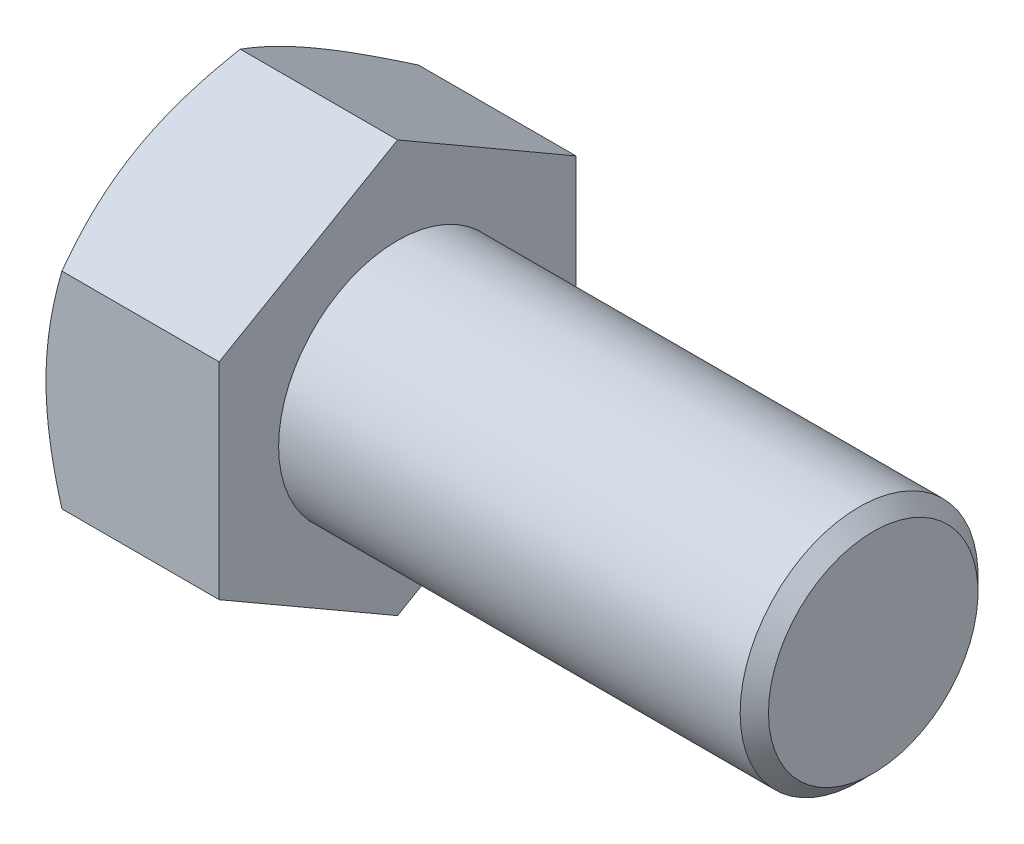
ISO-10303-21;
HEADER;
FILE_DESCRIPTION(('STEP AP214'),'2;1');
FILE_NAME('part.step','',(''),(''),'','','');
FILE_SCHEMA(('AUTOMOTIVE_DESIGN { 1 0 10303 214 1 1 1 1 }'));
ENDSEC;
DATA;
#1=APPLICATION_CONTEXT('core data for automotive mechanical design processes');
#2=APPLICATION_PROTOCOL_DEFINITION('international standard','automotive_design',2000,#1);
#3=PRODUCT_CONTEXT('',#1,'mechanical');
#4=PRODUCT('Part','Part','',(#3));
#5=PRODUCT_RELATED_PRODUCT_CATEGORY('part','',(#4));
#6=PRODUCT_DEFINITION_FORMATION('','',#4);
#7=PRODUCT_DEFINITION_CONTEXT('part definition',#1,'design');
#8=PRODUCT_DEFINITION('design','',#6,#7);
#9=PRODUCT_DEFINITION_SHAPE('','',#8);
#10=(LENGTH_UNIT() NAMED_UNIT(*) SI_UNIT(.MILLI.,.METRE.));
#11=(NAMED_UNIT(*) PLANE_ANGLE_UNIT() SI_UNIT($,.RADIAN.));
#12=(NAMED_UNIT(*) SI_UNIT($,.STERADIAN.) SOLID_ANGLE_UNIT());
#13=UNCERTAINTY_MEASURE_WITH_UNIT(LENGTH_MEASURE(1.E-05),#10,'distance_accuracy_value','');
#14=(GEOMETRIC_REPRESENTATION_CONTEXT(3) GLOBAL_UNCERTAINTY_ASSIGNED_CONTEXT((#13)) GLOBAL_UNIT_ASSIGNED_CONTEXT((#10,
#11,#12)) REPRESENTATION_CONTEXT('',''));
#15=CARTESIAN_POINT('',(0.,0.,0.));
#16=DIRECTION('',(0.,0.,1.));
#17=DIRECTION('',(1.,0.,0.));
#18=AXIS2_PLACEMENT_3D('',#15,#16,#17);
#19=CARTESIAN_POINT('',(9.2456,5.49926131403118,-9.525));
#20=DIRECTION('',(0.,-0.866025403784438,0.500000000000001));
#21=DIRECTION('',(0.,-0.500000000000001,-0.866025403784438));
#22=AXIS2_PLACEMENT_3D('',#19,#20,#21);
#23=PLANE('',#22);
#24=CARTESIAN_POINT('',(0.850805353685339,10.9986380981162,0.0002));
#25=CARTESIAN_POINT('',(0.781023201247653,10.8777523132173,-0.209180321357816));
#26=CARTESIAN_POINT('',(0.714408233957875,10.7564158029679,-0.419341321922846));
#27=CARTESIAN_POINT('',(0.588391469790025,10.5127697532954,-0.841348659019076));
#28=CARTESIAN_POINT('',(0.528992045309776,10.3904599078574,-1.05319552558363));
#29=CARTESIAN_POINT('',(0.362766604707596,10.0215595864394,-1.69214962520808));
#30=CARTESIAN_POINT('',(0.268218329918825,9.77351282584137,-2.12177921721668));
#31=CARTESIAN_POINT('',(0.157351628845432,9.40232220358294,-2.76470023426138));
#32=CARTESIAN_POINT('',(0.125769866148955,9.28028730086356,-2.97607088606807));
#33=CARTESIAN_POINT('',(0.0728092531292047,9.03565248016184,-3.39979082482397));
#34=CARTESIAN_POINT('',(0.0514305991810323,8.91305255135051,-3.61214013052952));
#35=CARTESIAN_POINT('',(0.0194239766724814,8.66764818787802,-4.03719295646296));
#36=CARTESIAN_POINT('',(0.00878323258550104,8.54484417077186,-4.24989575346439));
#37=CARTESIAN_POINT('',(-0.00152146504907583,8.29912270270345,-4.67549782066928));
#38=CARTESIAN_POINT('',(-0.00118575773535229,8.17620525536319,-4.88839708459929));
#39=CARTESIAN_POINT('',(0.00969884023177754,7.9464080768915,-5.28641747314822));
#40=CARTESIAN_POINT('',(0.0189199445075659,7.83951212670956,-5.4715666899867));
#41=CARTESIAN_POINT('',(0.0454848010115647,7.62597023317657,-5.84143209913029));
#42=CARTESIAN_POINT('',(0.0628291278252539,7.5193243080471,-6.02614825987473));
#43=CARTESIAN_POINT('',(0.126636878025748,7.19979976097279,-6.57958100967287));
#44=CARTESIAN_POINT('',(0.184867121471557,6.98748672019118,-6.94731798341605));
#45=CARTESIAN_POINT('',(0.330443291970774,6.56060850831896,-7.68669273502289));
#46=CARTESIAN_POINT('',(0.41840629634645,6.3460978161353,-8.05823615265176));
#47=CARTESIAN_POINT('',(0.618045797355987,5.92027529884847,-8.79578238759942));
#48=CARTESIAN_POINT('',(0.729675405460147,5.70895802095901,-9.16179464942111));
#49=CARTESIAN_POINT('',(0.850805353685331,5.49914584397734,-9.5252));
#50=B_SPLINE_CURVE_WITH_KNOTS('',3,(#24,#25,#26,#27,#28,#29,#30,#31,#32,#33,#34,#35,#36,#37,#38,
#39,#40,#41,#42,#43,#44,#45,#46,#47,#48,#49),.UNSPECIFIED.,.F.,.F.,(4,2,2,2,2,2,2,2,2,2,2,2,4),
(0.,0.754861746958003,1.50997101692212,3.02340406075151,3.76154608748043,4.49970232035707,
5.23697928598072,5.97423347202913,6.61604550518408,7.25790294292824,8.54252993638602,
9.85564695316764,11.1661863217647),.UNSPECIFIED.);
#51=CARTESIAN_POINT('',(0.850738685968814,10.9985226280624,0.));
#52=VERTEX_POINT('',#51);
#53=CARTESIAN_POINT('',(0.,8.24889197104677,-4.76250000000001));
#54=VERTEX_POINT('',#53);
#55=EDGE_CURVE('E54',#52,#54,#50,.T.);
#56=ORIENTED_EDGE('',*,*,#55,.F.);
#57=DIRECTION('',(-1.,0.,0.));
#58=VECTOR('',#57,1.);
#59=CARTESIAN_POINT('',(9.2456,10.9985226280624,0.));
#60=LINE('',#59,#58);
#61=CARTESIAN_POINT('',(9.2456,10.9985226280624,0.));
#62=VERTEX_POINT('',#61);
#63=EDGE_CURVE('E153',#62,#52,#60,.T.);
#64=ORIENTED_EDGE('',*,*,#63,.F.);
#65=DIRECTION('',(0.,0.500000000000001,0.866025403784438));
#66=VECTOR('',#65,1.);
#67=CARTESIAN_POINT('',(9.2456,5.49926131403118,-9.525));
#68=LINE('',#67,#66);
#69=CARTESIAN_POINT('',(9.2456,5.49926131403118,-9.525));
#70=VERTEX_POINT('',#69);
#71=EDGE_CURVE('E245',#70,#62,#68,.T.);
#72=ORIENTED_EDGE('',*,*,#71,.F.);
#73=DIRECTION('',(-1.,0.,0.));
#74=VECTOR('',#73,1.);
#75=CARTESIAN_POINT('',(9.2456,5.49926131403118,-9.525));
#76=LINE('',#75,#74);
#77=CARTESIAN_POINT('',(0.850738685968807,5.49926131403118,-9.525));
#78=VERTEX_POINT('',#77);
#79=EDGE_CURVE('E137',#70,#78,#76,.T.);
#80=ORIENTED_EDGE('',*,*,#79,.T.);
#81=EDGE_CURVE('E131',#54,#78,#50,.T.);
#82=ORIENTED_EDGE('',*,*,#81,.F.);
#83=EDGE_LOOP('',(#56,#64,#72,#80,#82));
#84=FACE_BOUND('',#83,.T.);
#85=ADVANCED_FACE('F39',(#84),#23,.F.);
#86=CARTESIAN_POINT('',(9.2456,10.9985226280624,0.));
#87=DIRECTION('',(0.,-0.866025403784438,-0.500000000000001));
#88=DIRECTION('',(0.,0.500000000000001,-0.866025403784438));
#89=AXIS2_PLACEMENT_3D('',#86,#87,#88);
#90=PLANE('',#89);
#91=CARTESIAN_POINT('',(0.850805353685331,5.49914584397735,9.5252));
#92=CARTESIAN_POINT('',(0.781023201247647,5.62003162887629,9.31581967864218));
#93=CARTESIAN_POINT('',(0.714408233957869,5.74136813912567,9.10565867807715));
#94=CARTESIAN_POINT('',(0.58839146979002,5.98501418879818,8.68365134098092));
#95=CARTESIAN_POINT('',(0.52899204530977,6.10732403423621,8.47180447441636));
#96=CARTESIAN_POINT('',(0.362766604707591,6.47622435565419,7.83285037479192));
#97=CARTESIAN_POINT('',(0.268218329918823,6.72427111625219,7.40322078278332));
#98=CARTESIAN_POINT('',(0.15735162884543,7.09546173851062,6.76029976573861));
#99=CARTESIAN_POINT('',(0.125769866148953,7.21749664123,6.54892911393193));
#100=CARTESIAN_POINT('',(0.0728092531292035,7.46213146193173,6.12520917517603));
#101=CARTESIAN_POINT('',(0.0514305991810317,7.58473139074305,5.91285986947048));
#102=CARTESIAN_POINT('',(0.0194239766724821,7.83013575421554,5.48780704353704));
#103=CARTESIAN_POINT('',(0.00878323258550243,7.9529397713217,5.27510424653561));
#104=CARTESIAN_POINT('',(-0.00152146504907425,8.19866123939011,4.84950217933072));
#105=CARTESIAN_POINT('',(-0.00118575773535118,8.32157868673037,4.63660291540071));
#106=CARTESIAN_POINT('',(0.00969884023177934,8.55137586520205,4.23858252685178));
#107=CARTESIAN_POINT('',(0.0189199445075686,8.658271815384,4.0534333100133));
#108=CARTESIAN_POINT('',(0.0454848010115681,8.87181370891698,3.68356790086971));
#109=CARTESIAN_POINT('',(0.062829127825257,8.97845963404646,3.49885174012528));
#110=CARTESIAN_POINT('',(0.126636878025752,9.29798418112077,2.94541899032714));
#111=CARTESIAN_POINT('',(0.184867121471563,9.51029722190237,2.57768201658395));
#112=CARTESIAN_POINT('',(0.330443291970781,9.9371754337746,1.83830726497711));
#113=CARTESIAN_POINT('',(0.418406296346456,10.1516861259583,1.46676384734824));
#114=CARTESIAN_POINT('',(0.618045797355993,10.5775086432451,0.729217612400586));
#115=CARTESIAN_POINT('',(0.729675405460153,10.7888259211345,0.363205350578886));
#116=CARTESIAN_POINT('',(0.850805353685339,10.9986380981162,-0.000199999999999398));
#117=B_SPLINE_CURVE_WITH_KNOTS('',3,(#91,#92,#93,#94,#95,#96,#97,#98,#99,#100,#101,#102,#103,
#104,#105,#106,#107,#108,#109,#110,#111,#112,#113,#114,#115,#116),.UNSPECIFIED.,.F.,.F.,(4,2,2,
2,2,2,2,2,2,2,2,2,4),(0.,0.754861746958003,1.50997101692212,3.02340406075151,3.76154608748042,
4.49970232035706,5.23697928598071,5.97423347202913,6.61604550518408,7.25790294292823,
8.54252993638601,9.85564695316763,11.1661863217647),.UNSPECIFIED.);
#118=CARTESIAN_POINT('',(0.850738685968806,5.49926131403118,9.525));
#119=VERTEX_POINT('',#118);
#120=CARTESIAN_POINT('',(0.,8.24889197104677,4.76250000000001));
#121=VERTEX_POINT('',#120);
#122=EDGE_CURVE('E64',#119,#121,#117,.T.);
#123=ORIENTED_EDGE('',*,*,#122,.F.);
#124=DIRECTION('',(-1.,0.,0.));
#125=VECTOR('',#124,1.);
#126=CARTESIAN_POINT('',(9.2456,5.49926131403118,9.525));
#127=LINE('',#126,#125);
#128=CARTESIAN_POINT('',(9.2456,5.49926131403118,9.525));
#129=VERTEX_POINT('',#128);
#130=EDGE_CURVE('E150',#129,#119,#127,.T.);
#131=ORIENTED_EDGE('',*,*,#130,.F.);
#132=DIRECTION('',(0.,-0.500000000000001,0.866025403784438));
#133=VECTOR('',#132,1.);
#134=CARTESIAN_POINT('',(9.2456,10.9985226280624,0.));
#135=LINE('',#134,#133);
#136=EDGE_CURVE('E239',#62,#129,#135,.T.);
#137=ORIENTED_EDGE('',*,*,#136,.F.);
#138=ORIENTED_EDGE('',*,*,#63,.T.);
#139=EDGE_CURVE('E168',#121,#52,#117,.T.);
#140=ORIENTED_EDGE('',*,*,#139,.F.);
#141=EDGE_LOOP('',(#123,#131,#137,#138,#140));
#142=FACE_BOUND('',#141,.T.);
#143=ADVANCED_FACE('F175',(#142),#90,.F.);
#144=CARTESIAN_POINT('',(9.2456,5.49926131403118,9.525));
#145=DIRECTION('',(0.,0.,-1.));
#146=DIRECTION('',(0.,1.,0.));
#147=AXIS2_PLACEMENT_3D('',#144,#145,#146);
#148=PLANE('',#147);
#149=CARTESIAN_POINT('',(4.65297862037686,-14.781011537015,9.52500000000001));
#150=CARTESIAN_POINT('',(4.55200114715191,-14.5729402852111,9.525));
#151=CARTESIAN_POINT('',(4.45152657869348,-14.3646250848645,9.525));
#152=CARTESIAN_POINT('',(4.25169715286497,-13.9474558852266,9.525));
#153=CARTESIAN_POINT('',(4.15234230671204,-13.7386018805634,9.525));
#154=CARTESIAN_POINT('',(3.85610205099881,-13.1110997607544,9.525));
#155=CARTESIAN_POINT('',(3.66107082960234,-12.6915729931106,9.525));
#156=CARTESIAN_POINT('',(3.27608312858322,-11.8474364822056,9.525));
#157=CARTESIAN_POINT('',(3.08615996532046,-11.4228115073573,9.525));
#158=CARTESIAN_POINT('',(2.71407238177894,-10.5701875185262,9.525));
#159=CARTESIAN_POINT('',(2.53190759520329,-10.1421886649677,9.525));
#160=CARTESIAN_POINT('',(2.17173180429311,-9.26840827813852,9.525));
#161=CARTESIAN_POINT('',(1.99403865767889,-8.82249500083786,9.525));
#162=CARTESIAN_POINT('',(1.65207801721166,-7.92545654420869,9.525));
#163=CARTESIAN_POINT('',(1.48781202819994,-7.47433078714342,9.525));
#164=CARTESIAN_POINT('',(1.17701101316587,-6.56698486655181,9.525));
#165=CARTESIAN_POINT('',(1.03044020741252,-6.11077709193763,9.525));
#166=CARTESIAN_POINT('',(0.759723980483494,-5.19183461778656,9.525));
#167=CARTESIAN_POINT('',(0.635571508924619,-4.72910201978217,9.525));
#168=CARTESIAN_POINT('',(0.416296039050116,-3.79927533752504,9.525));
#169=CARTESIAN_POINT('',(0.32101917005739,-3.33221854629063,9.525));
#170=CARTESIAN_POINT('',(0.203895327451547,-2.62737339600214,9.525));
#171=CARTESIAN_POINT('',(0.169151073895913,-2.39169815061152,9.525));
#172=CARTESIAN_POINT('',(0.108940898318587,-1.91917305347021,9.525));
#173=CARTESIAN_POINT('',(0.0834740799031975,-1.68232331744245,9.525));
#174=CARTESIAN_POINT('',(0.042646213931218,-1.21086692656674,9.525));
#175=CARTESIAN_POINT('',(0.0271575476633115,-0.976271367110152,9.525));
#176=CARTESIAN_POINT('',(0.00611497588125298,-0.506635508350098,9.525));
#177=CARTESIAN_POINT('',(0.000560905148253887,-0.271595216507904,9.525));
#178=CARTESIAN_POINT('',(-0.000479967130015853,0.198511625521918,9.525));
#179=CARTESIAN_POINT('',(0.00403333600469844,0.433578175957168,9.525));
#180=CARTESIAN_POINT('',(0.0230169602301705,0.903311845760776,9.525));
#181=CARTESIAN_POINT('',(0.0374877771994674,1.13797894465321,9.525));
#182=CARTESIAN_POINT('',(0.0838926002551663,1.70156520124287,9.525));
#183=CARTESIAN_POINT('',(0.12052919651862,2.03010533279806,9.525));
#184=CARTESIAN_POINT('',(0.211324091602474,2.68473880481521,9.525));
#185=CARTESIAN_POINT('',(0.265484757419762,3.01083180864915,9.525));
#186=CARTESIAN_POINT('',(0.45138010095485,3.98506326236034,9.525));
#187=CARTESIAN_POINT('',(0.606495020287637,4.62879899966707,9.525));
#188=CARTESIAN_POINT('',(0.875429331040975,5.59158230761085,9.525));
#189=CARTESIAN_POINT('',(0.972405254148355,5.91562142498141,9.525));
#190=CARTESIAN_POINT('',(1.17640873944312,6.56055109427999,9.525));
#191=CARTESIAN_POINT('',(1.28343637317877,6.88144162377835,9.525));
#192=CARTESIAN_POINT('',(1.50582732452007,7.5201782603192,9.525));
#193=CARTESIAN_POINT('',(1.6211879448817,7.83802531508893,9.52499999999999));
#194=CARTESIAN_POINT('',(1.85888923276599,8.47108431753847,9.52499999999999));
#195=CARTESIAN_POINT('',(1.98122977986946,8.78629631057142,9.52499999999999));
#196=CARTESIAN_POINT('',(2.30063477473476,9.58716274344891,9.52499999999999));
#197=CARTESIAN_POINT('',(2.50178184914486,10.0711868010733,9.52499999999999));
#198=CARTESIAN_POINT('',(2.9147317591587,11.0346830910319,9.52499999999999));
#199=CARTESIAN_POINT('',(3.12653548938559,11.5141549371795,9.52499999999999));
#200=CARTESIAN_POINT('',(3.55844219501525,12.4695072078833,9.52499999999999));
#201=CARTESIAN_POINT('',(3.77854763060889,12.9453865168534,9.52499999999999));
#202=CARTESIAN_POINT('',(4.22520690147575,13.8940827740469,9.52499999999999));
#203=CARTESIAN_POINT('',(4.4517605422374,14.3668998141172,9.52499999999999));
#204=CARTESIAN_POINT('',(4.91030379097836,15.3106675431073,9.52499999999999));
#205=CARTESIAN_POINT('',(5.14230026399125,15.7816148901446,9.52499999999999));
#206=CARTESIAN_POINT('',(5.61043419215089,16.7214473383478,9.52499999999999));
#207=CARTESIAN_POINT('',(5.84657167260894,17.1903324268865,9.52499999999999));
#208=CARTESIAN_POINT('',(6.32217781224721,18.1263065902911,9.52499999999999));
#209=CARTESIAN_POINT('',(6.56164589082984,18.5933959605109,9.52499999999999));
#210=CARTESIAN_POINT('',(7.04336394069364,19.5261387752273,9.52499999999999));
#211=CARTESIAN_POINT('',(7.28561392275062,19.9917922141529,9.52499999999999));
#212=CARTESIAN_POINT('',(7.96929589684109,21.2980525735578,9.52499999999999));
#213=CARTESIAN_POINT('',(8.41334550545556,22.1372892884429,9.52499999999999));
#214=CARTESIAN_POINT('',(9.30698696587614,23.8128512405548,9.52499999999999));
#215=CARTESIAN_POINT('',(9.75657908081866,24.6491763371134,9.52499999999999));
#216=CARTESIAN_POINT('',(10.6586387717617,26.3171534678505,9.52499999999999));
#217=CARTESIAN_POINT('',(11.1110942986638,27.1488120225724,9.52499999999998));
#218=CARTESIAN_POINT('',(11.7921739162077,28.3949535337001,9.52499999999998));
#219=CARTESIAN_POINT('',(12.0195924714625,28.8100962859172,9.52499999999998));
#220=CARTESIAN_POINT('',(12.4751463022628,29.639987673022,9.52499999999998));
#221=CARTESIAN_POINT('',(12.7032815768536,30.0547363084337,9.52499999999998));
#222=CARTESIAN_POINT('',(12.9317320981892,30.4693112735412,9.52499999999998));
#223=B_SPLINE_CURVE_WITH_KNOTS('',3,(#149,#150,#151,#152,#153,#154,#155,#156,#157,#158,#159,
#160,#161,#162,#163,#164,#165,#166,#167,#168,#169,#170,#171,#172,#173,#174,#175,#176,#177,#178,
#179,#180,#181,#182,#183,#184,#185,#186,#187,#188,#189,#190,#191,#192,#193,#194,#195,#196,#197,
#198,#199,#200,#201,#202,#203,#204,#205,#206,#207,#208,#209,#210,#211,#212,#213,#214,#215,#216,
#217,#218,#219,#220,#221,#222),.UNSPECIFIED.,.F.,.F.,(4,2,2,2,2,2,2,2,2,2,2,2,2,2,2,2,2,2,2,2,2,
2,2,2,2,2,2,2,2,2,2,2,2,2,2,2,4),(0.,0.693836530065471,1.38768000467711,2.7755719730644,
4.17100213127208,5.56636633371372,7.00624082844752,8.44627647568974,9.88334978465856,
11.3199703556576,12.7487952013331,13.4633089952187,14.17775373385,14.8828692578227,
15.5879730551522,16.2930841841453,16.9982304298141,17.9894005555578,18.9807046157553,
20.9643780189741,21.979010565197,22.9936503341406,24.0079631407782,25.0222584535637,
26.5945433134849,28.1669603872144,29.7398471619,31.3126865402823,32.8876294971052,
34.4625820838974,36.0372634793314,37.6119509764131,40.4603369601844,43.3088586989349,
46.1491565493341,47.5692138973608,48.9892693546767),.UNSPECIFIED.);
#224=CARTESIAN_POINT('',(0.850738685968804,-5.49926131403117,9.525));
#225=VERTEX_POINT('',#224);
#226=CARTESIAN_POINT('',(0.,0.,9.525));
#227=VERTEX_POINT('',#226);
#228=EDGE_CURVE('E255',#225,#227,#223,.T.);
#229=ORIENTED_EDGE('',*,*,#228,.F.);
#230=DIRECTION('',(-1.,0.,0.));
#231=VECTOR('',#230,1.);
#232=CARTESIAN_POINT('',(9.2456,-5.49926131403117,9.525));
#233=LINE('',#232,#231);
#234=CARTESIAN_POINT('',(9.2456,-5.49926131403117,9.525));
#235=VERTEX_POINT('',#234);
#236=EDGE_CURVE('E142',#235,#225,#233,.T.);
#237=ORIENTED_EDGE('',*,*,#236,.F.);
#238=DIRECTION('',(0.,-1.,0.));
#239=VECTOR('',#238,1.);
#240=CARTESIAN_POINT('',(9.2456,5.49926131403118,9.525));
#241=LINE('',#240,#239);
#242=EDGE_CURVE('E236',#129,#235,#241,.T.);
#243=ORIENTED_EDGE('',*,*,#242,.F.);
#244=ORIENTED_EDGE('',*,*,#130,.T.);
#245=EDGE_CURVE('E188',#227,#119,#223,.T.);
#246=ORIENTED_EDGE('',*,*,#245,.F.);
#247=EDGE_LOOP('',(#229,#237,#243,#244,#246));
#248=FACE_BOUND('',#247,.T.);
#249=ADVANCED_FACE('F257',(#248),#148,.F.);
#250=CARTESIAN_POINT('',(9.2456,-10.9985226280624,0.));
#251=DIRECTION('',(0.,0.866025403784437,-0.500000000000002));
#252=DIRECTION('',(0.,0.500000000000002,0.866025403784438));
#253=AXIS2_PLACEMENT_3D('',#250,#251,#252);
#254=PLANE('',#253);
#255=CARTESIAN_POINT('',(0.850805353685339,-10.9986380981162,-0.000200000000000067));
#256=CARTESIAN_POINT('',(0.781023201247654,-10.8777523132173,0.209180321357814));
#257=CARTESIAN_POINT('',(0.714408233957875,-10.7564158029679,0.419341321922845));
#258=CARTESIAN_POINT('',(0.588391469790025,-10.5127697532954,0.841348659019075));
#259=CARTESIAN_POINT('',(0.528992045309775,-10.3904599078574,1.05319552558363));
#260=CARTESIAN_POINT('',(0.362766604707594,-10.0215595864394,1.69214962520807));
#261=CARTESIAN_POINT('',(0.268218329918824,-9.77351282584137,2.12177921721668));
#262=CARTESIAN_POINT('',(0.157351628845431,-9.40232220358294,2.76470023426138));
#263=CARTESIAN_POINT('',(0.125769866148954,-9.28028730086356,2.97607088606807));
#264=CARTESIAN_POINT('',(0.0728092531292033,-9.03565248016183,3.39979082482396));
#265=CARTESIAN_POINT('',(0.051430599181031,-8.91305255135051,3.61214013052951));
#266=CARTESIAN_POINT('',(0.01942397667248,-8.66764818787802,4.03719295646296));
#267=CARTESIAN_POINT('',(0.00878323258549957,-8.54484417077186,4.24989575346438));
#268=CARTESIAN_POINT('',(-0.00152146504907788,-8.29912270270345,4.67549782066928));
#269=CARTESIAN_POINT('',(-0.00118575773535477,-8.17620525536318,4.88839708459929));
#270=CARTESIAN_POINT('',(0.00969884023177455,-7.9464080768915,5.28641747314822));
#271=CARTESIAN_POINT('',(0.0189199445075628,-7.83951212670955,5.4715666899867));
#272=CARTESIAN_POINT('',(0.0454848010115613,-7.62597023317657,5.84143209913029));
#273=CARTESIAN_POINT('',(0.0628291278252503,-7.5193243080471,6.02614825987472));
#274=CARTESIAN_POINT('',(0.126636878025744,-7.19979976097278,6.57958100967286));
#275=CARTESIAN_POINT('',(0.184867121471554,-6.98748672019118,6.94731798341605));
#276=CARTESIAN_POINT('',(0.330443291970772,-6.56060850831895,7.68669273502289));
#277=CARTESIAN_POINT('',(0.418406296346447,-6.34609781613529,8.05823615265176));
#278=CARTESIAN_POINT('',(0.618045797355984,-5.92027529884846,8.79578238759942));
#279=CARTESIAN_POINT('',(0.729675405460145,-5.708958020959,9.16179464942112));
#280=CARTESIAN_POINT('',(0.850805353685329,-5.49914584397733,9.5252));
#281=B_SPLINE_CURVE_WITH_KNOTS('',3,(#255,#256,#257,#258,#259,#260,#261,#262,#263,#264,#265,
#266,#267,#268,#269,#270,#271,#272,#273,#274,#275,#276,#277,#278,#279,#280),.UNSPECIFIED.,.F.,
.F.,(4,2,2,2,2,2,2,2,2,2,2,2,4),(0.,0.754861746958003,1.50997101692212,3.02340406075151,
3.76154608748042,4.49970232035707,5.23697928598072,5.97423347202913,6.61604550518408,
7.25790294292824,8.54252993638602,9.85564695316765,11.1661863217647),.UNSPECIFIED.);
#282=CARTESIAN_POINT('',(0.850738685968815,-10.9985226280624,0.));
#283=VERTEX_POINT('',#282);
#284=CARTESIAN_POINT('',(0.,-8.24889197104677,4.76250000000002));
#285=VERTEX_POINT('',#284);
#286=EDGE_CURVE('E172',#283,#285,#281,.T.);
#287=ORIENTED_EDGE('',*,*,#286,.F.);
#288=DIRECTION('',(-1.,0.,0.));
#289=VECTOR('',#288,1.);
#290=CARTESIAN_POINT('',(9.2456,-10.9985226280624,0.));
#291=LINE('',#290,#289);
#292=CARTESIAN_POINT('',(9.2456,-10.9985226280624,0.));
#293=VERTEX_POINT('',#292);
#294=EDGE_CURVE('E136',#293,#283,#291,.T.);
#295=ORIENTED_EDGE('',*,*,#294,.F.);
#296=DIRECTION('',(0.,-0.500000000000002,-0.866025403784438));
#297=VECTOR('',#296,1.);
#298=CARTESIAN_POINT('',(9.2456,-10.9985226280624,0.));
#299=LINE('',#298,#297);
#300=EDGE_CURVE('E234',#235,#293,#299,.T.);
#301=ORIENTED_EDGE('',*,*,#300,.F.);
#302=ORIENTED_EDGE('',*,*,#236,.T.);
#303=EDGE_CURVE('E176',#285,#225,#281,.T.);
#304=ORIENTED_EDGE('',*,*,#303,.F.);
#305=EDGE_LOOP('',(#287,#295,#301,#302,#304));
#306=FACE_BOUND('',#305,.T.);
#307=ADVANCED_FACE('F229',(#306),#254,.F.);
#308=CARTESIAN_POINT('',(9.2456,-5.4992613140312,-9.525));
#309=DIRECTION('',(0.,0.866025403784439,0.5));
#310=DIRECTION('',(0.,-0.5,0.866025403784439));
#311=AXIS2_PLACEMENT_3D('',#308,#309,#310);
#312=PLANE('',#311);
#313=CARTESIAN_POINT('',(0.850805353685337,-5.49914584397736,-9.5252));
#314=CARTESIAN_POINT('',(0.781023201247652,-5.6200316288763,-9.31581967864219));
#315=CARTESIAN_POINT('',(0.714408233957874,-5.74136813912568,-9.10565867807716));
#316=CARTESIAN_POINT('',(0.588391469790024,-5.98501418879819,-8.68365134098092));
#317=CARTESIAN_POINT('',(0.528992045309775,-6.10732403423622,-8.47180447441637));
#318=CARTESIAN_POINT('',(0.362766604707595,-6.4762243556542,-7.83285037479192));
#319=CARTESIAN_POINT('',(0.268218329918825,-6.7242711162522,-7.40322078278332));
#320=CARTESIAN_POINT('',(0.157351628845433,-7.09546173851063,-6.76029976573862));
#321=CARTESIAN_POINT('',(0.125769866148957,-7.21749664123,-6.54892911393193));
#322=CARTESIAN_POINT('',(0.0728092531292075,-7.46213146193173,-6.12520917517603));
#323=CARTESIAN_POINT('',(0.0514305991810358,-7.58473139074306,-5.91285986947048));
#324=CARTESIAN_POINT('',(0.0194239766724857,-7.83013575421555,-5.48780704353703));
#325=CARTESIAN_POINT('',(0.00878323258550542,-7.95293977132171,-5.27510424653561));
#326=CARTESIAN_POINT('',(-0.00152146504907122,-8.19866123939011,-4.84950217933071));
#327=CARTESIAN_POINT('',(-0.00118575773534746,-8.32157868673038,-4.63660291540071));
#328=CARTESIAN_POINT('',(0.00969884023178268,-8.55137586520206,-4.23858252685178));
#329=CARTESIAN_POINT('',(0.0189199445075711,-8.65827181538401,-4.0534333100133));
#330=CARTESIAN_POINT('',(0.0454848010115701,-8.87181370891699,-3.68356790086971));
#331=CARTESIAN_POINT('',(0.0628291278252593,-8.97845963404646,-3.49885174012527));
#332=CARTESIAN_POINT('',(0.126636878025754,-9.29798418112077,-2.94541899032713));
#333=CARTESIAN_POINT('',(0.184867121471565,-9.51029722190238,-2.57768201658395));
#334=CARTESIAN_POINT('',(0.330443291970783,-9.9371754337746,-1.83830726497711));
#335=CARTESIAN_POINT('',(0.418406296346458,-10.1516861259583,-1.46676384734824));
#336=CARTESIAN_POINT('',(0.618045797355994,-10.5775086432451,-0.729217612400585));
#337=CARTESIAN_POINT('',(0.729675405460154,-10.7888259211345,-0.363205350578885));
#338=CARTESIAN_POINT('',(0.850805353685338,-10.9986380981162,0.000199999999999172));
#339=B_SPLINE_CURVE_WITH_KNOTS('',3,(#313,#314,#315,#316,#317,#318,#319,#320,#321,#322,#323,
#324,#325,#326,#327,#328,#329,#330,#331,#332,#333,#334,#335,#336,#337,#338),.UNSPECIFIED.,.F.,
.F.,(4,2,2,2,2,2,2,2,2,2,2,2,4),(0.,0.754861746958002,1.50997101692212,3.02340406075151,
3.76154608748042,4.49970232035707,5.23697928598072,5.97423347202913,6.61604550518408,
7.25790294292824,8.54252993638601,9.85564695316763,11.1661863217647),.UNSPECIFIED.);
#340=CARTESIAN_POINT('',(0.850738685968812,-5.4992613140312,-9.525));
#341=VERTEX_POINT('',#340);
#342=CARTESIAN_POINT('',(0.,-8.24889197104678,-4.7625));
#343=VERTEX_POINT('',#342);
#344=EDGE_CURVE('E114',#341,#343,#339,.T.);
#345=ORIENTED_EDGE('',*,*,#344,.F.);
#346=DIRECTION('',(-1.,0.,0.));
#347=VECTOR('',#346,1.);
#348=CARTESIAN_POINT('',(9.2456,-5.4992613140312,-9.525));
#349=LINE('',#348,#347);
#350=CARTESIAN_POINT('',(9.2456,-5.4992613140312,-9.525));
#351=VERTEX_POINT('',#350);
#352=EDGE_CURVE('E130',#351,#341,#349,.T.);
#353=ORIENTED_EDGE('',*,*,#352,.F.);
#354=DIRECTION('',(0.,0.5,-0.866025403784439));
#355=VECTOR('',#354,1.);
#356=CARTESIAN_POINT('',(9.2456,-5.4992613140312,-9.525));
#357=LINE('',#356,#355);
#358=EDGE_CURVE('E235',#293,#351,#357,.T.);
#359=ORIENTED_EDGE('',*,*,#358,.F.);
#360=ORIENTED_EDGE('',*,*,#294,.T.);
#361=EDGE_CURVE('E135',#343,#283,#339,.T.);
#362=ORIENTED_EDGE('',*,*,#361,.F.);
#363=EDGE_LOOP('',(#345,#353,#359,#360,#362));
#364=FACE_BOUND('',#363,.T.);
#365=ADVANCED_FACE('F129',(#364),#312,.F.);
#366=CARTESIAN_POINT('',(9.2456,5.49926131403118,-9.525));
#367=DIRECTION('',(0.,0.,1.));
#368=DIRECTION('',(1.,0.,0.));
#369=AXIS2_PLACEMENT_3D('',#366,#367,#368);
#370=PLANE('',#369);
#371=CARTESIAN_POINT('',(4.65297862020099,-14.7810115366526,-9.525));
#372=CARTESIAN_POINT('',(4.55200114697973,-14.5729402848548,-9.525));
#373=CARTESIAN_POINT('',(4.45152657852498,-14.3646250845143,-9.525));
#374=CARTESIAN_POINT('',(4.25169715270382,-13.9474558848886,-9.525));
#375=CARTESIAN_POINT('',(4.15234230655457,-13.7386018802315,-9.525));
#376=CARTESIAN_POINT('',(3.85610205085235,-13.1110997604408,-9.525));
#377=CARTESIAN_POINT('',(3.6610708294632,-12.6915729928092,-9.525));
#378=CARTESIAN_POINT('',(3.27608312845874,-11.8474364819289,-9.525));
#379=CARTESIAN_POINT('',(3.0861599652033,-11.4228115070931,-9.525));
#380=CARTESIAN_POINT('',(2.71407238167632,-10.5701875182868,-9.525));
#381=CARTESIAN_POINT('',(2.53190759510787,-10.1421886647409,-9.525));
#382=CARTESIAN_POINT('',(2.17173180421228,-9.26840827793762,-9.525));
#383=CARTESIAN_POINT('',(1.99403865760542,-8.82249500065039,-9.525));
#384=CARTESIAN_POINT('',(1.65207801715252,-7.92545654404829,-9.525));
#385=CARTESIAN_POINT('',(1.48781202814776,-7.47433078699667,-9.525));
#386=CARTESIAN_POINT('',(1.17701101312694,-6.56698486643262,-9.525));
#387=CARTESIAN_POINT('',(1.03044020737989,-6.11077709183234,-9.525));
#388=CARTESIAN_POINT('',(0.759723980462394,-5.19183461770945,-9.525));
#389=CARTESIAN_POINT('',(0.635571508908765,-4.72910201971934,-9.525));
#390=CARTESIAN_POINT('',(0.416296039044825,-3.79927533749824,-9.525));
#391=CARTESIAN_POINT('',(0.321019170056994,-3.33221854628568,-9.525));
#392=CARTESIAN_POINT('',(0.203895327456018,-2.62737339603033,-9.525));
#393=CARTESIAN_POINT('',(0.169151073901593,-2.39169815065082,-9.525));
#394=CARTESIAN_POINT('',(0.108940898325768,-1.91917305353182,-9.525));
#395=CARTESIAN_POINT('',(0.0834740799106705,-1.68232331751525,-9.525));
#396=CARTESIAN_POINT('',(0.0426462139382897,-1.21086692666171,-9.525));
#397=CARTESIAN_POINT('',(0.0271575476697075,-0.976271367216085,-9.525));
#398=CARTESIAN_POINT('',(0.00611497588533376,-0.506635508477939,-9.525));
#399=CARTESIAN_POINT('',(0.000560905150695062,-0.271595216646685,-9.525));
#400=CARTESIAN_POINT('',(-0.00047996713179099,0.198511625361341,-9.525));
#401=CARTESIAN_POINT('',(0.00403333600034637,0.433578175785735,-9.525));
#402=CARTESIAN_POINT('',(0.0230169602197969,0.903311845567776,-9.525));
#403=CARTESIAN_POINT('',(0.0374877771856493,1.1379789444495,-9.525));
#404=CARTESIAN_POINT('',(0.0838926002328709,1.70156520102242,-9.525));
#405=CARTESIAN_POINT('',(0.12052919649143,2.03010533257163,-9.525));
#406=CARTESIAN_POINT('',(0.211324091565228,2.68473880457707,-9.525));
#407=CARTESIAN_POINT('',(0.265484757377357,3.0108318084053,-9.525));
#408=CARTESIAN_POINT('',(0.451380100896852,3.98506326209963,-9.525));
#409=CARTESIAN_POINT('',(0.606495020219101,4.62879899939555,-9.525));
#410=CARTESIAN_POINT('',(0.875429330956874,5.59158230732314,-9.525));
#411=CARTESIAN_POINT('',(0.972405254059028,5.9156214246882,-9.525));
#412=CARTESIAN_POINT('',(1.1764087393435,6.56055109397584,-9.525));
#413=CARTESIAN_POINT('',(1.28343637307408,6.88144162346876,-9.525));
#414=CARTESIAN_POINT('',(1.50582732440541,7.52017825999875,-9.525));
#415=CARTESIAN_POINT('',(1.62118794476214,7.83802531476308,-9.525));
#416=CARTESIAN_POINT('',(1.85888923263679,8.47108431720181,-9.525));
#417=CARTESIAN_POINT('',(1.98122977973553,8.78629631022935,-9.525));
#418=CARTESIAN_POINT('',(2.30063477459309,9.58716274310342,-9.525));
#419=CARTESIAN_POINT('',(2.50178184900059,10.0711868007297,-9.525));
#420=CARTESIAN_POINT('',(2.91473175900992,11.0346830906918,-9.525));
#421=CARTESIAN_POINT('',(3.12653548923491,11.514154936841,-9.525));
#422=CARTESIAN_POINT('',(3.55844219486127,12.4695072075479,-9.525));
#423=CARTESIAN_POINT('',(3.77854763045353,12.9453865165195,-9.525));
#424=CARTESIAN_POINT('',(4.22520690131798,13.8940827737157,-9.525));
#425=CARTESIAN_POINT('',(4.45176054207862,14.3668998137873,-9.525));
#426=CARTESIAN_POINT('',(4.91030379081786,15.31066754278,-9.525));
#427=CARTESIAN_POINT('',(5.14230026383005,15.7816148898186,-9.525));
#428=CARTESIAN_POINT('',(5.61043419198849,16.7214473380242,-9.525));
#429=CARTESIAN_POINT('',(5.84657167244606,17.190332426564,-9.525));
#430=CARTESIAN_POINT('',(6.32217781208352,18.1263065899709,-9.525));
#431=CARTESIAN_POINT('',(6.56164589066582,18.5933959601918,-9.525));
#432=CARTESIAN_POINT('',(7.04336394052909,19.5261387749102,-9.525));
#433=CARTESIAN_POINT('',(7.28561392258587,19.9917922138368,-9.525));
#434=CARTESIAN_POINT('',(7.96929589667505,21.2980525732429,-9.525));
#435=CARTESIAN_POINT('',(8.41334550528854,22.137289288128,-9.525));
#436=CARTESIAN_POINT('',(9.30698696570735,23.81285124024,-9.525));
#437=CARTESIAN_POINT('',(9.75657908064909,24.6491763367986,-9.525));
#438=CARTESIAN_POINT('',(10.6586387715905,26.3171534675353,-9.525));
#439=CARTESIAN_POINT('',(11.1110942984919,27.1488120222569,-9.525));
#440=CARTESIAN_POINT('',(11.7921739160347,28.394953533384,-9.525));
#441=CARTESIAN_POINT('',(12.0195924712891,28.8100962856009,-9.525));
#442=CARTESIAN_POINT('',(12.4751463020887,29.6399876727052,-9.525));
#443=CARTESIAN_POINT('',(12.7032815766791,30.0547363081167,-9.525));
#444=CARTESIAN_POINT('',(12.9317320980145,30.469311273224,-9.525));
#445=B_SPLINE_CURVE_WITH_KNOTS('',3,(#371,#372,#373,#374,#375,#376,#377,#378,#379,#380,#381,
#382,#383,#384,#385,#386,#387,#388,#389,#390,#391,#392,#393,#394,#395,#396,#397,#398,#399,#400,
#401,#402,#403,#404,#405,#406,#407,#408,#409,#410,#411,#412,#413,#414,#415,#416,#417,#418,#419,
#420,#421,#422,#423,#424,#425,#426,#427,#428,#429,#430,#431,#432,#433,#434,#435,#436,#437,#438,
#439,#440,#441,#442,#443,#444),.UNSPECIFIED.,.F.,.F.,(4,2,2,2,2,2,2,2,2,2,2,2,2,2,2,2,2,2,2,2,2,
2,2,2,2,2,2,2,2,2,2,2,2,2,2,2,4),(0.,0.69383653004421,1.38768000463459,2.77557197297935,
4.17100213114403,5.56636633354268,7.00624082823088,8.44627647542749,9.88334978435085,
11.3199703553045,12.748795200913,13.4633089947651,14.177753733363,14.882869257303,
15.5879730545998,16.2930841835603,16.9982304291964,17.9894005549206,18.9807046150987,
20.9643780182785,21.979010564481,22.9936503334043,24.0079631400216,25.0222584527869,
26.5945433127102,28.1669603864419,29.7398471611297,31.3126865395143,32.8876294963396,
34.4625820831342,36.0372634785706,37.6119509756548,40.4603369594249,43.3088586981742,
46.1491565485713,47.569213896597,48.9892693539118),.UNSPECIFIED.);
#446=CARTESIAN_POINT('',(0.,0.,-9.525));
#447=VERTEX_POINT('',#446);
#448=EDGE_CURVE('E122',#78,#447,#445,.F.);
#449=ORIENTED_EDGE('',*,*,#448,.F.);
#450=ORIENTED_EDGE('',*,*,#79,.F.);
#451=DIRECTION('',(0.,1.,0.));
#452=VECTOR('',#451,1.);
#453=CARTESIAN_POINT('',(9.2456,5.49926131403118,-9.525));
#454=LINE('',#453,#452);
#455=EDGE_CURVE('E140',#351,#70,#454,.T.);
#456=ORIENTED_EDGE('',*,*,#455,.F.);
#457=ORIENTED_EDGE('',*,*,#352,.T.);
#458=EDGE_CURVE('E115',#447,#341,#445,.F.);
#459=ORIENTED_EDGE('',*,*,#458,.F.);
#460=EDGE_LOOP('',(#449,#450,#456,#457,#459));
#461=FACE_BOUND('',#460,.T.);
#462=ADVANCED_FACE('F132',(#461),#370,.F.);
#463=CARTESIAN_POINT('',(9.2456,10.9985226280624,0.));
#464=DIRECTION('',(1.,0.,0.));
#465=DIRECTION('',(0.,0.,-1.));
#466=AXIS2_PLACEMENT_3D('',#463,#464,#465);
#467=PLANE('',#466);
#468=CARTESIAN_POINT('',(9.2456,0.,0.));
#469=DIRECTION('',(1.,0.,0.));
#470=DIRECTION('',(0.,0.,-1.));
#471=AXIS2_PLACEMENT_3D('',#468,#469,#470);
#472=CIRCLE('',#471,6.35);
#473=CARTESIAN_POINT('',(9.2456,0.,-6.35));
#474=VERTEX_POINT('',#473);
#475=EDGE_CURVE('E244',#474,#474,#472,.F.);
#476=ORIENTED_EDGE('',*,*,#475,.T.);
#477=EDGE_LOOP('',(#476));
#478=FACE_BOUND('',#477,.T.);
#479=ORIENTED_EDGE('',*,*,#71,.T.);
#480=ORIENTED_EDGE('',*,*,#136,.T.);
#481=ORIENTED_EDGE('',*,*,#242,.T.);
#482=ORIENTED_EDGE('',*,*,#300,.T.);
#483=ORIENTED_EDGE('',*,*,#358,.T.);
#484=ORIENTED_EDGE('',*,*,#455,.T.);
#485=EDGE_LOOP('',(#479,#480,#481,#482,#483,#484));
#486=FACE_BOUND('',#485,.T.);
#487=ADVANCED_FACE('F256',(#478,#486),#467,.T.);
#488=CARTESIAN_POINT('',(0.,0.,0.));
#489=DIRECTION('',(-1.,0.,0.));
#490=DIRECTION('',(0.,0.,1.));
#491=AXIS2_PLACEMENT_3D('',#488,#489,#490);
#492=CYLINDRICAL_SURFACE('',#491,6.35);
#493=ORIENTED_EDGE('',*,*,#475,.F.);
#494=EDGE_LOOP('',(#493));
#495=FACE_BOUND('',#494,.T.);
#496=CARTESIAN_POINT('',(33.88995,0.,0.));
#497=DIRECTION('',(-1.,0.,0.));
#498=DIRECTION('',(0.,0.,1.));
#499=AXIS2_PLACEMENT_3D('',#496,#497,#498);
#500=CIRCLE('',#499,6.35);
#501=CARTESIAN_POINT('',(33.88995,0.,6.35));
#502=VERTEX_POINT('',#501);
#503=EDGE_CURVE('E247',#502,#502,#500,.T.);
#504=ORIENTED_EDGE('',*,*,#503,.T.);
#505=EDGE_LOOP('',(#504));
#506=FACE_BOUND('',#505,.T.);
#507=ADVANCED_FACE('F292',(#495,#506),#492,.T.);
#508=CARTESIAN_POINT('',(34.6456,0.,0.));
#509=DIRECTION('',(-1.,0.,0.));
#510=DIRECTION('',(0.,0.,1.));
#511=AXIS2_PLACEMENT_3D('',#508,#509,#510);
#512=CONICAL_SURFACE('',#511,5.59435,0.785398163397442);
#513=ORIENTED_EDGE('',*,*,#503,.F.);
#514=EDGE_LOOP('',(#513));
#515=FACE_BOUND('',#514,.T.);
#516=CARTESIAN_POINT('',(34.6456,0.,0.));
#517=DIRECTION('',(-1.,0.,0.));
#518=DIRECTION('',(0.,0.,1.));
#519=AXIS2_PLACEMENT_3D('',#516,#517,#518);
#520=CIRCLE('',#519,5.59435);
#521=CARTESIAN_POINT('',(34.6456,0.,5.59435));
#522=VERTEX_POINT('',#521);
#523=EDGE_CURVE('E249',#522,#522,#520,.T.);
#524=ORIENTED_EDGE('',*,*,#523,.T.);
#525=EDGE_LOOP('',(#524));
#526=FACE_BOUND('',#525,.T.);
#527=ADVANCED_FACE('F294',(#515,#526),#512,.T.);
#528=CARTESIAN_POINT('',(34.6456,0.,0.));
#529=DIRECTION('',(-1.,0.,0.));
#530=DIRECTION('',(0.,0.,1.));
#531=AXIS2_PLACEMENT_3D('',#528,#529,#530);
#532=PLANE('',#531);
#533=ORIENTED_EDGE('',*,*,#523,.F.);
#534=EDGE_LOOP('',(#533));
#535=FACE_BOUND('',#534,.T.);
#536=ADVANCED_FACE('F202',(#535),#532,.F.);
#537=CARTESIAN_POINT('',(0.,0.,0.));
#538=DIRECTION('',(1.,0.,0.));
#539=DIRECTION('',(0.,0.,-1.));
#540=AXIS2_PLACEMENT_3D('',#537,#538,#539);
#541=CONICAL_SURFACE('',#540,9.525,1.0471975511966);
#542=ORIENTED_EDGE('',*,*,#344,.T.);
#543=CARTESIAN_POINT('',(0.,0.,0.));
#544=DIRECTION('',(1.,0.,0.));
#545=DIRECTION('',(0.,0.,-1.));
#546=AXIS2_PLACEMENT_3D('',#543,#544,#545);
#547=CIRCLE('',#546,9.525);
#548=EDGE_CURVE('E43',#343,#447,#547,.T.);
#549=ORIENTED_EDGE('',*,*,#548,.T.);
#550=ORIENTED_EDGE('',*,*,#458,.T.);
#551=EDGE_LOOP('',(#542,#549,#550));
#552=FACE_BOUND('',#551,.T.);
#553=ADVANCED_FACE('F112',(#552),#541,.T.);
#554=ORIENTED_EDGE('',*,*,#286,.T.);
#555=EDGE_CURVE('E158',#285,#343,#547,.T.);
#556=ORIENTED_EDGE('',*,*,#555,.T.);
#557=ORIENTED_EDGE('',*,*,#361,.T.);
#558=EDGE_LOOP('',(#554,#556,#557));
#559=FACE_BOUND('',#558,.T.);
#560=ADVANCED_FACE('F201',(#559),#541,.T.);
#561=ORIENTED_EDGE('',*,*,#228,.T.);
#562=EDGE_CURVE('E160',#227,#285,#547,.T.);
#563=ORIENTED_EDGE('',*,*,#562,.T.);
#564=ORIENTED_EDGE('',*,*,#303,.T.);
#565=EDGE_LOOP('',(#561,#563,#564));
#566=FACE_BOUND('',#565,.T.);
#567=ADVANCED_FACE('F196',(#566),#541,.T.);
#568=ORIENTED_EDGE('',*,*,#245,.T.);
#569=ORIENTED_EDGE('',*,*,#122,.T.);
#570=CARTESIAN_POINT('',(0.,0.,0.));
#571=DIRECTION('',(-1.,0.,0.));
#572=DIRECTION('',(0.,0.,1.));
#573=AXIS2_PLACEMENT_3D('',#570,#571,#572);
#574=CIRCLE('',#573,9.525);
#575=EDGE_CURVE('E125',#227,#121,#574,.T.);
#576=ORIENTED_EDGE('',*,*,#575,.F.);
#577=EDGE_LOOP('',(#568,#569,#576));
#578=FACE_BOUND('',#577,.T.);
#579=ADVANCED_FACE('F205',(#578),#541,.T.);
#580=ORIENTED_EDGE('',*,*,#139,.T.);
#581=ORIENTED_EDGE('',*,*,#55,.T.);
#582=EDGE_CURVE('E48',#54,#121,#547,.T.);
#583=ORIENTED_EDGE('',*,*,#582,.T.);
#584=EDGE_LOOP('',(#580,#581,#583));
#585=FACE_BOUND('',#584,.T.);
#586=ADVANCED_FACE('F164',(#585),#541,.T.);
#587=ORIENTED_EDGE('',*,*,#81,.T.);
#588=ORIENTED_EDGE('',*,*,#448,.T.);
#589=EDGE_CURVE('E11',#447,#54,#547,.T.);
#590=ORIENTED_EDGE('',*,*,#589,.T.);
#591=EDGE_LOOP('',(#587,#588,#590));
#592=FACE_BOUND('',#591,.T.);
#593=ADVANCED_FACE('F261',(#592),#541,.T.);
#594=CARTESIAN_POINT('',(0.,10.9985226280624,0.));
#595=DIRECTION('',(1.,0.,0.));
#596=DIRECTION('',(0.,0.,-1.));
#597=AXIS2_PLACEMENT_3D('',#594,#595,#596);
#598=PLANE('',#597);
#599=ORIENTED_EDGE('',*,*,#589,.F.);
#600=ORIENTED_EDGE('',*,*,#548,.F.);
#601=ORIENTED_EDGE('',*,*,#555,.F.);
#602=ORIENTED_EDGE('',*,*,#562,.F.);
#603=ORIENTED_EDGE('',*,*,#575,.T.);
#604=ORIENTED_EDGE('',*,*,#582,.F.);
#605=EDGE_LOOP('',(#599,#600,#601,#602,#603,#604));
#606=FACE_BOUND('',#605,.T.);
#607=ADVANCED_FACE('F169',(#606),#598,.F.);
#608=CLOSED_SHELL('',(#85,#143,#249,#307,#365,#462,#487,#507,#527,#536,#553,#560,#567,#579,#586,
#593,#607));
#609=MANIFOLD_SOLID_BREP('B2',#608);
#610=ADVANCED_BREP_SHAPE_REPRESENTATION('',(#18,#609),#14);
#611=SHAPE_DEFINITION_REPRESENTATION(#9,#610);
ENDSEC;
END-ISO-10303-21;
